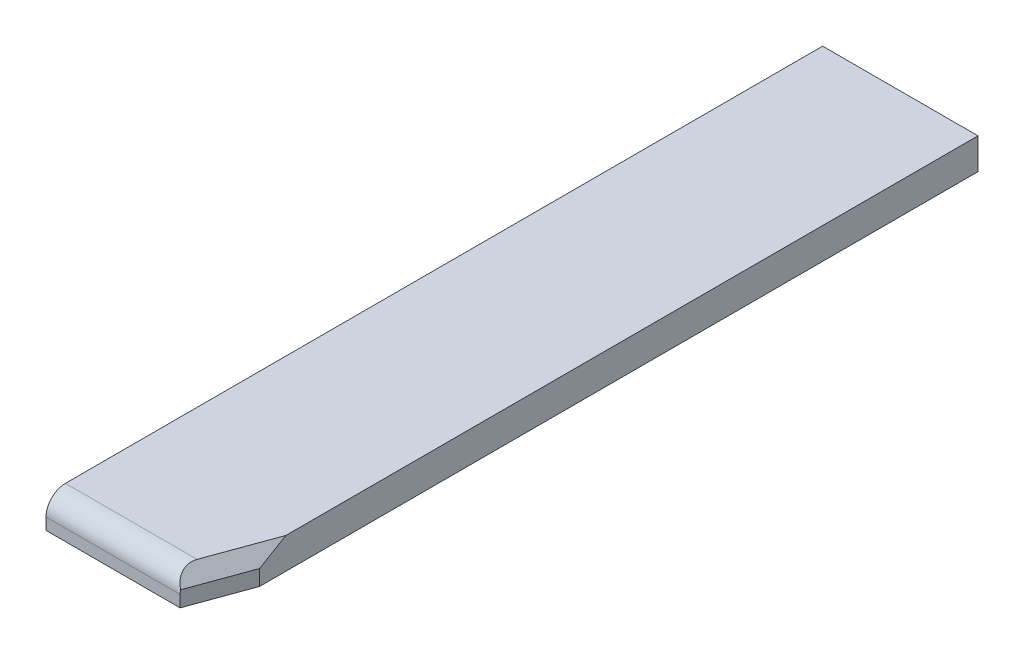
from build123d import *

# Parameters (mm, degrees)
ESQUISSE1_W             = 40
ESQUISSE1_H             = 8
EXTRUSION1_DEPTH        = 200
CHANFREIN1_SIZE         = 15
CHANFREIN1_SIZE2        = 5.459553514
CHANFREIN2_SIZE         = 4
CHANFREIN2_SIZE2        = 2.309401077
ENL_V_MAT_EXTRU_2_REACH = 206.118


with BuildPart() as part:
    # Esquisse1 → Extrusion1 (new body)
    with BuildSketch(Plane.XY):
        with Locations((0, 4)):
            Rectangle(ESQUISSE1_W, ESQUISSE1_H)
    extrude(amount=-EXTRUSION1_DEPTH)

    # Chanfrein1
    chanfrein1_edges = [part.edges().sort_by_distance(p)[0] for p in [
        (20, 4, 0),
    ]]
    chanfrein1_side = [part.faces().sort_by_distance(p)[0] for p in [
        (20, 4, -100),
    ]]
    chamfer(chanfrein1_edges, length=CHANFREIN1_SIZE, length2=CHANFREIN1_SIZE2, reference=chanfrein1_side[0])

    # Chanfrein2
    chanfrein2_edges = [part.edges().sort_by_distance(p)[0] for p in [
        (17.270223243, 8, -7.5),
    ]]
    chanfrein2_side = [part.faces().sort_by_distance(p)[0] for p in [
        (17.270223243, 4, -7.5),
    ]]
    chamfer(chanfrein2_edges, length=CHANFREIN2_SIZE, length2=CHANFREIN2_SIZE2, reference=chanfrein2_side[0])

    # Esquisse3 → Enl_v. mat.-Extru.2 (cut, up to next)
    with BuildSketch(Plane.ZY.offset(20), mode=Mode.PRIVATE) as enl_v_mat_extru_2_sk1:
        with BuildLine():
            Line((-5, 8), (0, 8))
            Line((0, 8), (0, 3))
            ThreePointArc((0, 3), (-1.464466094, 6.535533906), (-5, 8))
        make_face()
    enl_v_mat_extru_2_tool1 = extrude(enl_v_mat_extru_2_sk1.sketch, amount=-ENL_V_MAT_EXTRU_2_REACH, mode=Mode.PRIVATE) & part.part
    add(enl_v_mat_extru_2_tool1.solids().sort_by_distance((-20, 6.88316, -1.11684))[0], mode=Mode.SUBTRACT)


solid = part.part
